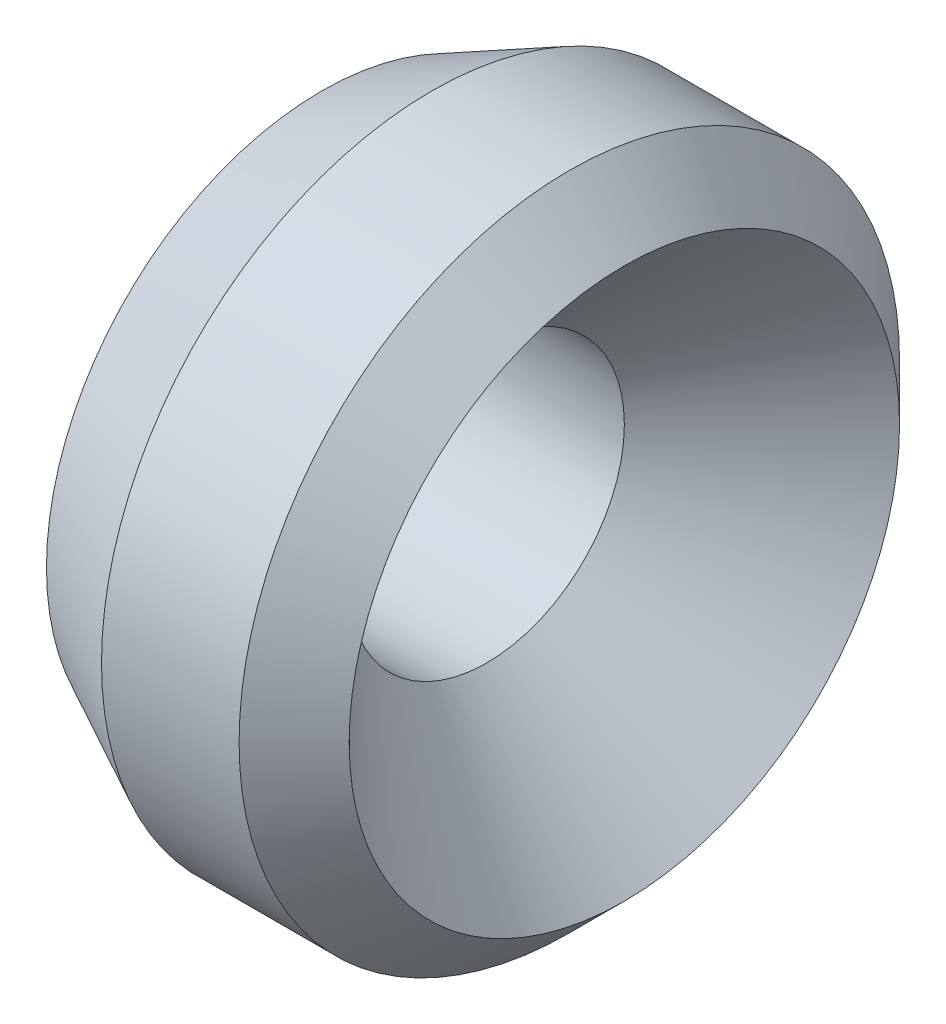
ISO-10303-21;
HEADER;
FILE_DESCRIPTION(('STEP AP214'),'2;1');
FILE_NAME('part.step','',(''),(''),'','','');
FILE_SCHEMA(('AUTOMOTIVE_DESIGN { 1 0 10303 214 1 1 1 1 }'));
ENDSEC;
DATA;
#1=APPLICATION_CONTEXT('core data for automotive mechanical design processes');
#2=APPLICATION_PROTOCOL_DEFINITION('international standard','automotive_design',2000,#1);
#3=PRODUCT_CONTEXT('',#1,'mechanical');
#4=PRODUCT('Part','Part','',(#3));
#5=PRODUCT_RELATED_PRODUCT_CATEGORY('part','',(#4));
#6=PRODUCT_DEFINITION_FORMATION('','',#4);
#7=PRODUCT_DEFINITION_CONTEXT('part definition',#1,'design');
#8=PRODUCT_DEFINITION('design','',#6,#7);
#9=PRODUCT_DEFINITION_SHAPE('','',#8);
#10=(LENGTH_UNIT() NAMED_UNIT(*) SI_UNIT(.MILLI.,.METRE.));
#11=(NAMED_UNIT(*) PLANE_ANGLE_UNIT() SI_UNIT($,.RADIAN.));
#12=(NAMED_UNIT(*) SI_UNIT($,.STERADIAN.) SOLID_ANGLE_UNIT());
#13=UNCERTAINTY_MEASURE_WITH_UNIT(LENGTH_MEASURE(1.E-05),#10,'distance_accuracy_value','');
#14=(GEOMETRIC_REPRESENTATION_CONTEXT(3) GLOBAL_UNCERTAINTY_ASSIGNED_CONTEXT((#13)) GLOBAL_UNIT_ASSIGNED_CONTEXT((#10,
#11,#12)) REPRESENTATION_CONTEXT('',''));
#15=CARTESIAN_POINT('',(0.,0.,0.));
#16=DIRECTION('',(0.,0.,1.));
#17=DIRECTION('',(1.,0.,0.));
#18=AXIS2_PLACEMENT_3D('',#15,#16,#17);
#19=CARTESIAN_POINT('',(-2.25839792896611,0.322997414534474,0.));
#20=DIRECTION('',(-1.,0.,0.));
#21=DIRECTION('',(0.,0.,1.));
#22=AXIS2_PLACEMENT_3D('',#19,#20,#21);
#23=CONICAL_SURFACE('',#22,12.,0.785398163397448);
#24=CARTESIAN_POINT('',(-2.25839792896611,0.322997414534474,0.));
#25=DIRECTION('',(1.,0.,0.));
#26=DIRECTION('',(0.,0.,-1.));
#27=AXIS2_PLACEMENT_3D('',#24,#25,#26);
#28=CIRCLE('',#27,12.);
#29=CARTESIAN_POINT('',(-2.25839792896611,0.322997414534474,-12.));
#30=VERTEX_POINT('',#29);
#31=EDGE_CURVE('E31',#30,#30,#28,.F.);
#32=ORIENTED_EDGE('',*,*,#31,.F.);
#33=EDGE_LOOP('',(#32));
#34=FACE_BOUND('',#33,.T.);
#35=CARTESIAN_POINT('',(-0.258397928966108,0.322997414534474,0.));
#36=DIRECTION('',(1.,0.,0.));
#37=DIRECTION('',(0.,0.,-1.));
#38=AXIS2_PLACEMENT_3D('',#35,#36,#37);
#39=CIRCLE('',#38,10.);
#40=CARTESIAN_POINT('',(-0.258397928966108,0.322997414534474,-10.));
#41=VERTEX_POINT('',#40);
#42=EDGE_CURVE('E28',#41,#41,#39,.F.);
#43=ORIENTED_EDGE('',*,*,#42,.T.);
#44=EDGE_LOOP('',(#43));
#45=FACE_BOUND('',#44,.T.);
#46=ADVANCED_FACE('F15',(#34,#45),#23,.T.);
#47=CARTESIAN_POINT('',(-0.258397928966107,0.322997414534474,0.));
#48=DIRECTION('',(1.,0.,0.));
#49=DIRECTION('',(0.,0.,-1.));
#50=AXIS2_PLACEMENT_3D('',#47,#48,#49);
#51=CONICAL_SURFACE('',#50,10.,0.785398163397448);
#52=ORIENTED_EDGE('',*,*,#42,.F.);
#53=EDGE_LOOP('',(#52));
#54=FACE_BOUND('',#53,.T.);
#55=CARTESIAN_POINT('',(-5.25839792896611,0.322997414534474,0.));
#56=DIRECTION('',(1.,0.,0.));
#57=DIRECTION('',(0.,0.,-1.));
#58=AXIS2_PLACEMENT_3D('',#55,#56,#57);
#59=CIRCLE('',#58,5.);
#60=CARTESIAN_POINT('',(-5.25839792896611,0.322997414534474,-5.));
#61=VERTEX_POINT('',#60);
#62=EDGE_CURVE('E34',#61,#61,#59,.F.);
#63=ORIENTED_EDGE('',*,*,#62,.T.);
#64=EDGE_LOOP('',(#63));
#65=FACE_BOUND('',#64,.T.);
#66=ADVANCED_FACE('F46',(#54,#65),#51,.F.);
#67=CARTESIAN_POINT('',(-3.75839792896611,0.322997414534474,0.));
#68=DIRECTION('',(1.,0.,0.));
#69=DIRECTION('',(0.,0.,-1.));
#70=AXIS2_PLACEMENT_3D('',#67,#68,#69);
#71=CYLINDRICAL_SURFACE('',#70,12.);
#72=ORIENTED_EDGE('',*,*,#31,.T.);
#73=EDGE_LOOP('',(#72));
#74=FACE_BOUND('',#73,.T.);
#75=CARTESIAN_POINT('',(-7.25839792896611,0.322997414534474,0.));
#76=DIRECTION('',(1.,0.,0.));
#77=DIRECTION('',(0.,1.,0.));
#78=AXIS2_PLACEMENT_3D('',#75,#76,#77);
#79=CIRCLE('',#78,12.);
#80=CARTESIAN_POINT('',(-7.25839792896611,12.3229974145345,0.));
#81=VERTEX_POINT('',#80);
#82=EDGE_CURVE('E26',#81,#81,#79,.F.);
#83=ORIENTED_EDGE('',*,*,#82,.F.);
#84=EDGE_LOOP('',(#83));
#85=FACE_BOUND('',#84,.T.);
#86=ADVANCED_FACE('F43',(#74,#85),#71,.T.);
#87=CARTESIAN_POINT('',(-35.9375234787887,0.322997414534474,0.));
#88=DIRECTION('',(1.,0.,0.));
#89=DIRECTION('',(0.,0.,-1.));
#90=AXIS2_PLACEMENT_3D('',#87,#88,#89);
#91=CYLINDRICAL_SURFACE('',#90,5.);
#92=ORIENTED_EDGE('',*,*,#62,.F.);
#93=EDGE_LOOP('',(#92));
#94=FACE_BOUND('',#93,.T.);
#95=CARTESIAN_POINT('',(-11.2583979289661,0.322997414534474,0.));
#96=DIRECTION('',(1.,0.,0.));
#97=DIRECTION('',(0.,0.,-1.));
#98=AXIS2_PLACEMENT_3D('',#95,#96,#97);
#99=CIRCLE('',#98,5.);
#100=CARTESIAN_POINT('',(-11.2583979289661,0.322997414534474,-5.));
#101=VERTEX_POINT('',#100);
#102=EDGE_CURVE('E19',#101,#101,#99,.T.);
#103=ORIENTED_EDGE('',*,*,#102,.F.);
#104=EDGE_LOOP('',(#103));
#105=FACE_BOUND('',#104,.T.);
#106=ADVANCED_FACE('F45',(#94,#105),#91,.F.);
#107=CARTESIAN_POINT('',(-7.25839792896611,0.322997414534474,0.));
#108=DIRECTION('',(1.,0.,0.));
#109=DIRECTION('',(0.,0.,-1.));
#110=AXIS2_PLACEMENT_3D('',#107,#108,#109);
#111=CONICAL_SURFACE('',#110,12.,0.463647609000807);
#112=ORIENTED_EDGE('',*,*,#82,.T.);
#113=EDGE_LOOP('',(#112));
#114=FACE_BOUND('',#113,.T.);
#115=CARTESIAN_POINT('',(-11.2583979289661,0.322997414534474,0.));
#116=DIRECTION('',(1.,0.,0.));
#117=DIRECTION('',(0.,0.,-1.));
#118=AXIS2_PLACEMENT_3D('',#115,#116,#117);
#119=CIRCLE('',#118,10.);
#120=CARTESIAN_POINT('',(-11.2583979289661,0.322997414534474,-10.));
#121=VERTEX_POINT('',#120);
#122=EDGE_CURVE('E10',#121,#121,#119,.F.);
#123=ORIENTED_EDGE('',*,*,#122,.F.);
#124=EDGE_LOOP('',(#123));
#125=FACE_BOUND('',#124,.T.);
#126=ADVANCED_FACE('F40',(#114,#125),#111,.T.);
#127=CARTESIAN_POINT('',(-11.2583979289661,5.32299741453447,0.));
#128=DIRECTION('',(-1.,0.,0.));
#129=DIRECTION('',(0.,0.,1.));
#130=AXIS2_PLACEMENT_3D('',#127,#128,#129);
#131=PLANE('',#130);
#132=ORIENTED_EDGE('',*,*,#122,.T.);
#133=EDGE_LOOP('',(#132));
#134=FACE_BOUND('',#133,.T.);
#135=ORIENTED_EDGE('',*,*,#102,.T.);
#136=EDGE_LOOP('',(#135));
#137=FACE_BOUND('',#136,.T.);
#138=ADVANCED_FACE('F17',(#134,#137),#131,.T.);
#139=CLOSED_SHELL('',(#46,#66,#86,#106,#126,#138));
#140=MANIFOLD_SOLID_BREP('B1',#139);
#141=ADVANCED_BREP_SHAPE_REPRESENTATION('',(#18,#140),#14);
#142=SHAPE_DEFINITION_REPRESENTATION(#9,#141);
ENDSEC;
END-ISO-10303-21;
